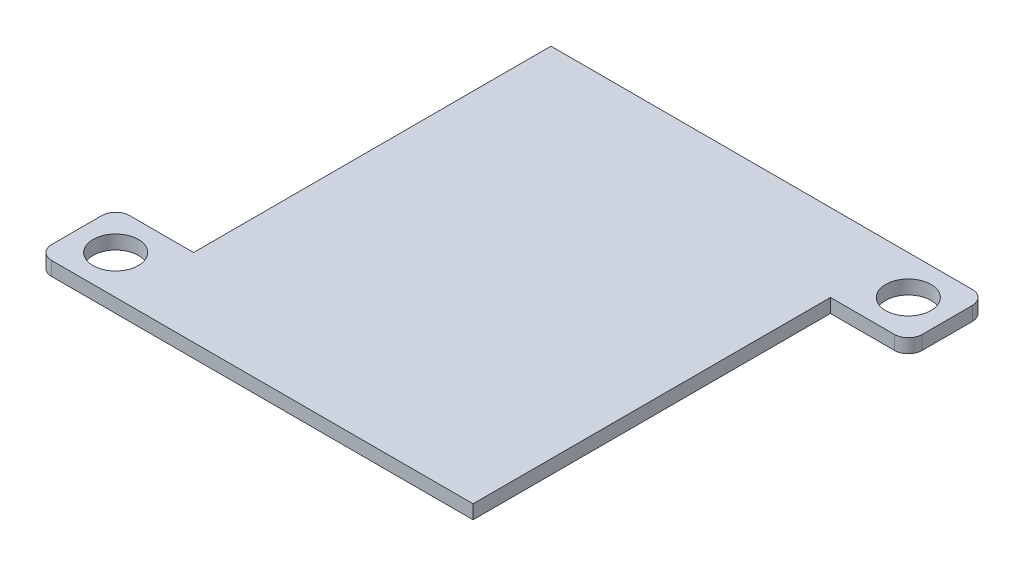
ISO-10303-21;
HEADER;
FILE_DESCRIPTION(('STEP AP214'),'2;1');
FILE_NAME('part.step','',(''),(''),'','','');
FILE_SCHEMA(('AUTOMOTIVE_DESIGN { 1 0 10303 214 1 1 1 1 }'));
ENDSEC;
DATA;
#1=APPLICATION_CONTEXT('core data for automotive mechanical design processes');
#2=APPLICATION_PROTOCOL_DEFINITION('international standard','automotive_design',2000,#1);
#3=PRODUCT_CONTEXT('',#1,'mechanical');
#4=PRODUCT('Part','Part','',(#3));
#5=PRODUCT_RELATED_PRODUCT_CATEGORY('part','',(#4));
#6=PRODUCT_DEFINITION_FORMATION('','',#4);
#7=PRODUCT_DEFINITION_CONTEXT('part definition',#1,'design');
#8=PRODUCT_DEFINITION('design','',#6,#7);
#9=PRODUCT_DEFINITION_SHAPE('','',#8);
#10=(LENGTH_UNIT() NAMED_UNIT(*) SI_UNIT(.MILLI.,.METRE.));
#11=(NAMED_UNIT(*) PLANE_ANGLE_UNIT() SI_UNIT($,.RADIAN.));
#12=(NAMED_UNIT(*) SI_UNIT($,.STERADIAN.) SOLID_ANGLE_UNIT());
#13=UNCERTAINTY_MEASURE_WITH_UNIT(LENGTH_MEASURE(1.E-05),#10,'distance_accuracy_value','');
#14=(GEOMETRIC_REPRESENTATION_CONTEXT(3) GLOBAL_UNCERTAINTY_ASSIGNED_CONTEXT((#13)) GLOBAL_UNIT_ASSIGNED_CONTEXT((#10,
#11,#12)) REPRESENTATION_CONTEXT('',''));
#15=CARTESIAN_POINT('',(0.,0.,0.));
#16=DIRECTION('',(0.,0.,1.));
#17=DIRECTION('',(1.,0.,0.));
#18=AXIS2_PLACEMENT_3D('',#15,#16,#17);
#19=CARTESIAN_POINT('',(0.,1.,0.));
#20=DIRECTION('',(0.,1.,0.));
#21=DIRECTION('',(0.,0.,1.));
#22=AXIS2_PLACEMENT_3D('',#19,#20,#21);
#23=PLANE('',#22);
#24=CARTESIAN_POINT('',(15.7634815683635,1.,-12.7117909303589));
#25=DIRECTION('',(0.,1.,0.));
#26=DIRECTION('',(0.,0.,1.));
#27=AXIS2_PLACEMENT_3D('',#24,#25,#26);
#28=CIRCLE('',#27,1.63);
#29=CARTESIAN_POINT('',(15.7634815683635,1.,-11.0817909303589));
#30=VERTEX_POINT('',#29);
#31=EDGE_CURVE('E224',#30,#30,#28,.T.);
#32=ORIENTED_EDGE('',*,*,#31,.F.);
#33=EDGE_LOOP('',(#32));
#34=FACE_BOUND('',#33,.T.);
#35=DIRECTION('',(-1.,0.,0.));
#36=VECTOR('',#35,1.);
#37=CARTESIAN_POINT('',(-12.7365184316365,1.,10.1882090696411));
#38=LINE('',#37,#36);
#39=CARTESIAN_POINT('',(-12.7365184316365,1.,10.1882090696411));
#40=VERTEX_POINT('',#39);
#41=CARTESIAN_POINT('',(-17.3365184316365,1.,10.1882090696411));
#42=VERTEX_POINT('',#41);
#43=EDGE_CURVE('E121',#40,#42,#38,.T.);
#44=ORIENTED_EDGE('',*,*,#43,.T.);
#45=CARTESIAN_POINT('',(-17.3365184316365,1.,11.1882090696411));
#46=DIRECTION('',(0.,1.,0.));
#47=DIRECTION('',(0.,0.,1.));
#48=AXIS2_PLACEMENT_3D('',#45,#46,#47);
#49=CIRCLE('',#48,1.);
#50=CARTESIAN_POINT('',(-18.3365184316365,1.,11.1882090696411));
#51=VERTEX_POINT('',#50);
#52=EDGE_CURVE('E171',#42,#51,#49,.T.);
#53=ORIENTED_EDGE('',*,*,#52,.T.);
#54=DIRECTION('',(0.,0.,1.));
#55=VECTOR('',#54,1.);
#56=CARTESIAN_POINT('',(-18.3365184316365,1.,15.7882090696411));
#57=LINE('',#56,#55);
#58=CARTESIAN_POINT('',(-18.3365184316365,1.,14.7882090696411));
#59=VERTEX_POINT('',#58);
#60=EDGE_CURVE('E131',#51,#59,#57,.T.);
#61=ORIENTED_EDGE('',*,*,#60,.T.);
#62=CARTESIAN_POINT('',(-17.3365184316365,1.,14.7882090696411));
#63=DIRECTION('',(0.,1.,0.));
#64=DIRECTION('',(0.,0.,1.));
#65=AXIS2_PLACEMENT_3D('',#62,#63,#64);
#66=CIRCLE('',#65,1.);
#67=CARTESIAN_POINT('',(-17.3365184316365,1.,15.7882090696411));
#68=VERTEX_POINT('',#67);
#69=EDGE_CURVE('E169',#59,#68,#66,.T.);
#70=ORIENTED_EDGE('',*,*,#69,.T.);
#71=DIRECTION('',(1.,0.,0.));
#72=VECTOR('',#71,1.);
#73=CARTESIAN_POINT('',(-13.2965184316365,1.,15.7882090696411));
#74=LINE('',#73,#72);
#75=CARTESIAN_POINT('',(12.9634815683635,1.,15.7882090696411));
#76=VERTEX_POINT('',#75);
#77=EDGE_CURVE('E230',#68,#76,#74,.T.);
#78=ORIENTED_EDGE('',*,*,#77,.T.);
#79=DIRECTION('',(0.,0.,-1.));
#80=VECTOR('',#79,1.);
#81=CARTESIAN_POINT('',(12.9634815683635,1.,15.7882090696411));
#82=LINE('',#81,#80);
#83=CARTESIAN_POINT('',(12.9634815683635,1.,-9.91179093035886));
#84=VERTEX_POINT('',#83);
#85=EDGE_CURVE('E228',#76,#84,#82,.T.);
#86=ORIENTED_EDGE('',*,*,#85,.T.);
#87=DIRECTION('',(1.,0.,0.));
#88=VECTOR('',#87,1.);
#89=CARTESIAN_POINT('',(12.9634815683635,1.,-9.91179093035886));
#90=LINE('',#89,#88);
#91=CARTESIAN_POINT('',(17.5634815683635,1.,-9.91179093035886));
#92=VERTEX_POINT('',#91);
#93=EDGE_CURVE('E210',#84,#92,#90,.T.);
#94=ORIENTED_EDGE('',*,*,#93,.T.);
#95=CARTESIAN_POINT('',(17.5634815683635,1.,-10.9117909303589));
#96=DIRECTION('',(0.,1.,0.));
#97=DIRECTION('',(0.,0.,1.));
#98=AXIS2_PLACEMENT_3D('',#95,#96,#97);
#99=CIRCLE('',#98,1.);
#100=CARTESIAN_POINT('',(18.5634815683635,1.,-10.9117909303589));
#101=VERTEX_POINT('',#100);
#102=EDGE_CURVE('E166',#92,#101,#99,.T.);
#103=ORIENTED_EDGE('',*,*,#102,.T.);
#104=DIRECTION('',(0.,0.,-1.));
#105=VECTOR('',#104,1.);
#106=CARTESIAN_POINT('',(18.5634815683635,1.,-15.5117909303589));
#107=LINE('',#106,#105);
#108=CARTESIAN_POINT('',(18.5634815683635,1.,-14.5117909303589));
#109=VERTEX_POINT('',#108);
#110=EDGE_CURVE('E185',#101,#109,#107,.T.);
#111=ORIENTED_EDGE('',*,*,#110,.T.);
#112=CARTESIAN_POINT('',(17.5634815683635,1.,-14.5117909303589));
#113=DIRECTION('',(0.,1.,0.));
#114=DIRECTION('',(0.,0.,1.));
#115=AXIS2_PLACEMENT_3D('',#112,#113,#114);
#116=CIRCLE('',#115,1.);
#117=CARTESIAN_POINT('',(17.5634815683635,1.,-15.5117909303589));
#118=VERTEX_POINT('',#117);
#119=EDGE_CURVE('E47',#109,#118,#116,.T.);
#120=ORIENTED_EDGE('',*,*,#119,.T.);
#121=DIRECTION('',(-1.,0.,0.));
#122=VECTOR('',#121,1.);
#123=CARTESIAN_POINT('',(12.9634815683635,1.,-15.5117909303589));
#124=LINE('',#123,#122);
#125=CARTESIAN_POINT('',(-12.7365184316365,1.,-15.5117909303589));
#126=VERTEX_POINT('',#125);
#127=EDGE_CURVE('E136',#118,#126,#124,.T.);
#128=ORIENTED_EDGE('',*,*,#127,.T.);
#129=DIRECTION('',(0.,0.,1.));
#130=VECTOR('',#129,1.);
#131=CARTESIAN_POINT('',(-12.7365184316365,1.,10.1882090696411));
#132=LINE('',#131,#130);
#133=EDGE_CURVE('E132',#126,#40,#132,.T.);
#134=ORIENTED_EDGE('',*,*,#133,.T.);
#135=EDGE_LOOP('',(#44,#53,#61,#70,#78,#86,#94,#103,#111,#120,#128,#134));
#136=FACE_BOUND('',#135,.T.);
#137=CARTESIAN_POINT('',(-15.5365184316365,1.,12.9882090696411));
#138=DIRECTION('',(0.,1.,0.));
#139=DIRECTION('',(0.,0.,1.));
#140=AXIS2_PLACEMENT_3D('',#137,#138,#139);
#141=CIRCLE('',#140,1.63);
#142=CARTESIAN_POINT('',(-15.5365184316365,1.,14.6182090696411));
#143=VERTEX_POINT('',#142);
#144=EDGE_CURVE('E237',#143,#143,#141,.T.);
#145=ORIENTED_EDGE('',*,*,#144,.F.);
#146=EDGE_LOOP('',(#145));
#147=FACE_BOUND('',#146,.T.);
#148=ADVANCED_FACE('F32',(#34,#136,#147),#23,.T.);
#149=CARTESIAN_POINT('',(0.,0.,0.));
#150=DIRECTION('',(0.,1.,0.));
#151=DIRECTION('',(0.,0.,1.));
#152=AXIS2_PLACEMENT_3D('',#149,#150,#151);
#153=PLANE('',#152);
#154=DIRECTION('',(0.,0.,1.));
#155=VECTOR('',#154,1.);
#156=CARTESIAN_POINT('',(-18.3365184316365,0.,15.7882090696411));
#157=LINE('',#156,#155);
#158=CARTESIAN_POINT('',(-18.3365184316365,0.,11.1882090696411));
#159=VERTEX_POINT('',#158);
#160=CARTESIAN_POINT('',(-18.3365184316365,0.,14.7882090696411));
#161=VERTEX_POINT('',#160);
#162=EDGE_CURVE('E216',#159,#161,#157,.T.);
#163=ORIENTED_EDGE('',*,*,#162,.F.);
#164=CARTESIAN_POINT('',(-17.3365184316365,0.,11.1882090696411));
#165=DIRECTION('',(0.,1.,0.));
#166=DIRECTION('',(0.,0.,1.));
#167=AXIS2_PLACEMENT_3D('',#164,#165,#166);
#168=CIRCLE('',#167,1.);
#169=CARTESIAN_POINT('',(-17.3365184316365,0.,10.1882090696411));
#170=VERTEX_POINT('',#169);
#171=EDGE_CURVE('E163',#159,#170,#168,.F.);
#172=ORIENTED_EDGE('',*,*,#171,.T.);
#173=DIRECTION('',(-1.,0.,0.));
#174=VECTOR('',#173,1.);
#175=CARTESIAN_POINT('',(-12.7365184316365,0.,10.1882090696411));
#176=LINE('',#175,#174);
#177=CARTESIAN_POINT('',(-12.7365184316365,0.,10.1882090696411));
#178=VERTEX_POINT('',#177);
#179=EDGE_CURVE('E221',#178,#170,#176,.T.);
#180=ORIENTED_EDGE('',*,*,#179,.F.);
#181=DIRECTION('',(0.,0.,1.));
#182=VECTOR('',#181,1.);
#183=CARTESIAN_POINT('',(-12.7365184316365,0.,10.1882090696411));
#184=LINE('',#183,#182);
#185=CARTESIAN_POINT('',(-12.7365184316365,0.,-15.5117909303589));
#186=VERTEX_POINT('',#185);
#187=EDGE_CURVE('E144',#186,#178,#184,.T.);
#188=ORIENTED_EDGE('',*,*,#187,.F.);
#189=DIRECTION('',(-1.,0.,0.));
#190=VECTOR('',#189,1.);
#191=CARTESIAN_POINT('',(12.9634815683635,0.,-15.5117909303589));
#192=LINE('',#191,#190);
#193=CARTESIAN_POINT('',(17.5634815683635,0.,-15.5117909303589));
#194=VERTEX_POINT('',#193);
#195=EDGE_CURVE('E140',#194,#186,#192,.T.);
#196=ORIENTED_EDGE('',*,*,#195,.F.);
#197=CARTESIAN_POINT('',(17.5634815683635,0.,-14.5117909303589));
#198=DIRECTION('',(0.,1.,0.));
#199=DIRECTION('',(0.,0.,1.));
#200=AXIS2_PLACEMENT_3D('',#197,#198,#199);
#201=CIRCLE('',#200,1.);
#202=CARTESIAN_POINT('',(18.5634815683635,0.,-14.5117909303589));
#203=VERTEX_POINT('',#202);
#204=EDGE_CURVE('E159',#194,#203,#201,.F.);
#205=ORIENTED_EDGE('',*,*,#204,.T.);
#206=DIRECTION('',(0.,0.,-1.));
#207=VECTOR('',#206,1.);
#208=CARTESIAN_POINT('',(18.5634815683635,0.,-15.5117909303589));
#209=LINE('',#208,#207);
#210=CARTESIAN_POINT('',(18.5634815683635,0.,-10.9117909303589));
#211=VERTEX_POINT('',#210);
#212=EDGE_CURVE('E184',#211,#203,#209,.T.);
#213=ORIENTED_EDGE('',*,*,#212,.F.);
#214=CARTESIAN_POINT('',(17.5634815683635,0.,-10.9117909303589));
#215=DIRECTION('',(0.,1.,0.));
#216=DIRECTION('',(0.,0.,1.));
#217=AXIS2_PLACEMENT_3D('',#214,#215,#216);
#218=CIRCLE('',#217,1.);
#219=CARTESIAN_POINT('',(17.5634815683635,0.,-9.91179093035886));
#220=VERTEX_POINT('',#219);
#221=EDGE_CURVE('E157',#211,#220,#218,.F.);
#222=ORIENTED_EDGE('',*,*,#221,.T.);
#223=DIRECTION('',(1.,0.,0.));
#224=VECTOR('',#223,1.);
#225=CARTESIAN_POINT('',(12.9634815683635,0.,-9.91179093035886));
#226=LINE('',#225,#224);
#227=CARTESIAN_POINT('',(12.9634815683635,0.,-9.91179093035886));
#228=VERTEX_POINT('',#227);
#229=EDGE_CURVE('E195',#228,#220,#226,.T.);
#230=ORIENTED_EDGE('',*,*,#229,.F.);
#231=DIRECTION('',(0.,0.,-1.));
#232=VECTOR('',#231,1.);
#233=CARTESIAN_POINT('',(12.9634815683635,0.,15.7882090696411));
#234=LINE('',#233,#232);
#235=CARTESIAN_POINT('',(12.9634815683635,0.,15.7882090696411));
#236=VERTEX_POINT('',#235);
#237=EDGE_CURVE('E198',#236,#228,#234,.T.);
#238=ORIENTED_EDGE('',*,*,#237,.F.);
#239=DIRECTION('',(1.,0.,0.));
#240=VECTOR('',#239,1.);
#241=CARTESIAN_POINT('',(12.9634815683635,0.,15.7882090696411));
#242=LINE('',#241,#240);
#243=CARTESIAN_POINT('',(-17.3365184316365,0.,15.7882090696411));
#244=VERTEX_POINT('',#243);
#245=EDGE_CURVE('E215',#244,#236,#242,.T.);
#246=ORIENTED_EDGE('',*,*,#245,.F.);
#247=CARTESIAN_POINT('',(-17.3365184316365,0.,14.7882090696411));
#248=DIRECTION('',(0.,1.,0.));
#249=DIRECTION('',(0.,0.,1.));
#250=AXIS2_PLACEMENT_3D('',#247,#248,#249);
#251=CIRCLE('',#250,1.);
#252=EDGE_CURVE('E161',#244,#161,#251,.F.);
#253=ORIENTED_EDGE('',*,*,#252,.T.);
#254=EDGE_LOOP('',(#163,#172,#180,#188,#196,#205,#213,#222,#230,#238,#246,#253));
#255=FACE_BOUND('',#254,.T.);
#256=CARTESIAN_POINT('',(15.7634815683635,0.,-12.7117909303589));
#257=DIRECTION('',(0.,1.,0.));
#258=DIRECTION('',(0.,0.,1.));
#259=AXIS2_PLACEMENT_3D('',#256,#257,#258);
#260=CIRCLE('',#259,1.63);
#261=CARTESIAN_POINT('',(15.7634815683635,0.,-11.0817909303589));
#262=VERTEX_POINT('',#261);
#263=EDGE_CURVE('E234',#262,#262,#260,.T.);
#264=ORIENTED_EDGE('',*,*,#263,.T.);
#265=EDGE_LOOP('',(#264));
#266=FACE_BOUND('',#265,.T.);
#267=CARTESIAN_POINT('',(-15.5365184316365,0.,12.9882090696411));
#268=DIRECTION('',(0.,1.,0.));
#269=DIRECTION('',(0.,0.,1.));
#270=AXIS2_PLACEMENT_3D('',#267,#268,#269);
#271=CIRCLE('',#270,1.63);
#272=CARTESIAN_POINT('',(-15.5365184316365,0.,14.6182090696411));
#273=VERTEX_POINT('',#272);
#274=EDGE_CURVE('E240',#273,#273,#271,.T.);
#275=ORIENTED_EDGE('',*,*,#274,.T.);
#276=EDGE_LOOP('',(#275));
#277=FACE_BOUND('',#276,.T.);
#278=ADVANCED_FACE('F190',(#255,#266,#277),#153,.F.);
#279=CARTESIAN_POINT('',(-12.7365184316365,1.,10.1882090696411));
#280=DIRECTION('',(1.,0.,0.));
#281=DIRECTION('',(0.,0.,-1.));
#282=AXIS2_PLACEMENT_3D('',#279,#280,#281);
#283=PLANE('',#282);
#284=ORIENTED_EDGE('',*,*,#187,.T.);
#285=DIRECTION('',(0.,-1.,0.));
#286=VECTOR('',#285,1.);
#287=CARTESIAN_POINT('',(-12.7365184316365,1.,10.1882090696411));
#288=LINE('',#287,#286);
#289=EDGE_CURVE('E126',#40,#178,#288,.T.);
#290=ORIENTED_EDGE('',*,*,#289,.F.);
#291=ORIENTED_EDGE('',*,*,#133,.F.);
#292=DIRECTION('',(0.,-1.,0.));
#293=VECTOR('',#292,1.);
#294=CARTESIAN_POINT('',(-12.7365184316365,1.,-15.5117909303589));
#295=LINE('',#294,#293);
#296=EDGE_CURVE('E202',#126,#186,#295,.T.);
#297=ORIENTED_EDGE('',*,*,#296,.T.);
#298=EDGE_LOOP('',(#284,#290,#291,#297));
#299=FACE_BOUND('',#298,.T.);
#300=ADVANCED_FACE('F142',(#299),#283,.F.);
#301=CARTESIAN_POINT('',(-12.7365184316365,1.,10.1882090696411));
#302=DIRECTION('',(0.,0.,1.));
#303=DIRECTION('',(1.,0.,0.));
#304=AXIS2_PLACEMENT_3D('',#301,#302,#303);
#305=PLANE('',#304);
#306=ORIENTED_EDGE('',*,*,#179,.T.);
#307=DIRECTION('',(0.,-1.,0.));
#308=VECTOR('',#307,1.);
#309=CARTESIAN_POINT('',(-17.3365184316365,1.,10.1882090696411));
#310=LINE('',#309,#308);
#311=EDGE_CURVE('E129',#170,#42,#310,.F.);
#312=ORIENTED_EDGE('',*,*,#311,.T.);
#313=ORIENTED_EDGE('',*,*,#43,.F.);
#314=ORIENTED_EDGE('',*,*,#289,.T.);
#315=EDGE_LOOP('',(#306,#312,#313,#314));
#316=FACE_BOUND('',#315,.T.);
#317=ADVANCED_FACE('F124',(#316),#305,.F.);
#318=CARTESIAN_POINT('',(-18.3365184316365,1.,15.7882090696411));
#319=DIRECTION('',(1.,0.,0.));
#320=DIRECTION('',(0.,0.,-1.));
#321=AXIS2_PLACEMENT_3D('',#318,#319,#320);
#322=PLANE('',#321);
#323=ORIENTED_EDGE('',*,*,#60,.F.);
#324=DIRECTION('',(0.,-1.,0.));
#325=VECTOR('',#324,1.);
#326=CARTESIAN_POINT('',(-18.3365184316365,1.,11.1882090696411));
#327=LINE('',#326,#325);
#328=EDGE_CURVE('E148',#51,#159,#327,.T.);
#329=ORIENTED_EDGE('',*,*,#328,.T.);
#330=ORIENTED_EDGE('',*,*,#162,.T.);
#331=DIRECTION('',(0.,-1.,0.));
#332=VECTOR('',#331,1.);
#333=CARTESIAN_POINT('',(-18.3365184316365,1.,14.7882090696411));
#334=LINE('',#333,#332);
#335=EDGE_CURVE('E145',#161,#59,#334,.F.);
#336=ORIENTED_EDGE('',*,*,#335,.T.);
#337=EDGE_LOOP('',(#323,#329,#330,#336));
#338=FACE_BOUND('',#337,.T.);
#339=ADVANCED_FACE('F274',(#338),#322,.F.);
#340=CARTESIAN_POINT('',(12.9634815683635,1.,15.7882090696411));
#341=DIRECTION('',(0.,0.,-1.));
#342=DIRECTION('',(-1.,0.,0.));
#343=AXIS2_PLACEMENT_3D('',#340,#341,#342);
#344=PLANE('',#343);
#345=ORIENTED_EDGE('',*,*,#77,.F.);
#346=DIRECTION('',(0.,-1.,0.));
#347=VECTOR('',#346,1.);
#348=CARTESIAN_POINT('',(-17.3365184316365,1.,15.7882090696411));
#349=LINE('',#348,#347);
#350=EDGE_CURVE('E173',#68,#244,#349,.T.);
#351=ORIENTED_EDGE('',*,*,#350,.T.);
#352=ORIENTED_EDGE('',*,*,#245,.T.);
#353=DIRECTION('',(0.,-1.,0.));
#354=VECTOR('',#353,1.);
#355=CARTESIAN_POINT('',(12.9634815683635,1.,15.7882090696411));
#356=LINE('',#355,#354);
#357=EDGE_CURVE('E146',#76,#236,#356,.T.);
#358=ORIENTED_EDGE('',*,*,#357,.F.);
#359=EDGE_LOOP('',(#345,#351,#352,#358));
#360=FACE_BOUND('',#359,.T.);
#361=ADVANCED_FACE('F271',(#360),#344,.F.);
#362=CARTESIAN_POINT('',(12.9634815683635,1.,15.7882090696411));
#363=DIRECTION('',(-1.,0.,0.));
#364=DIRECTION('',(0.,0.,1.));
#365=AXIS2_PLACEMENT_3D('',#362,#363,#364);
#366=PLANE('',#365);
#367=ORIENTED_EDGE('',*,*,#237,.T.);
#368=DIRECTION('',(0.,-1.,0.));
#369=VECTOR('',#368,1.);
#370=CARTESIAN_POINT('',(12.9634815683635,1.,-9.91179093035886));
#371=LINE('',#370,#369);
#372=EDGE_CURVE('E151',#84,#228,#371,.T.);
#373=ORIENTED_EDGE('',*,*,#372,.F.);
#374=ORIENTED_EDGE('',*,*,#85,.F.);
#375=ORIENTED_EDGE('',*,*,#357,.T.);
#376=EDGE_LOOP('',(#367,#373,#374,#375));
#377=FACE_BOUND('',#376,.T.);
#378=ADVANCED_FACE('F268',(#377),#366,.F.);
#379=CARTESIAN_POINT('',(12.9634815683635,1.,-9.91179093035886));
#380=DIRECTION('',(0.,0.,-1.));
#381=DIRECTION('',(-1.,0.,0.));
#382=AXIS2_PLACEMENT_3D('',#379,#380,#381);
#383=PLANE('',#382);
#384=ORIENTED_EDGE('',*,*,#229,.T.);
#385=DIRECTION('',(0.,-1.,0.));
#386=VECTOR('',#385,1.);
#387=CARTESIAN_POINT('',(17.5634815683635,1.,-9.91179093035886));
#388=LINE('',#387,#386);
#389=EDGE_CURVE('E11',#220,#92,#388,.F.);
#390=ORIENTED_EDGE('',*,*,#389,.T.);
#391=ORIENTED_EDGE('',*,*,#93,.F.);
#392=ORIENTED_EDGE('',*,*,#372,.T.);
#393=EDGE_LOOP('',(#384,#390,#391,#392));
#394=FACE_BOUND('',#393,.T.);
#395=ADVANCED_FACE('F207',(#394),#383,.F.);
#396=CARTESIAN_POINT('',(18.5634815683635,1.,-15.5117909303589));
#397=DIRECTION('',(-1.,0.,0.));
#398=DIRECTION('',(0.,0.,1.));
#399=AXIS2_PLACEMENT_3D('',#396,#397,#398);
#400=PLANE('',#399);
#401=ORIENTED_EDGE('',*,*,#212,.T.);
#402=DIRECTION('',(0.,-1.,0.));
#403=VECTOR('',#402,1.);
#404=CARTESIAN_POINT('',(18.5634815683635,1.,-14.5117909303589));
#405=LINE('',#404,#403);
#406=EDGE_CURVE('E40',#203,#109,#405,.F.);
#407=ORIENTED_EDGE('',*,*,#406,.T.);
#408=ORIENTED_EDGE('',*,*,#110,.F.);
#409=DIRECTION('',(0.,-1.,0.));
#410=VECTOR('',#409,1.);
#411=CARTESIAN_POINT('',(18.5634815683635,1.,-10.9117909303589));
#412=LINE('',#411,#410);
#413=EDGE_CURVE('E179',#101,#211,#412,.T.);
#414=ORIENTED_EDGE('',*,*,#413,.T.);
#415=EDGE_LOOP('',(#401,#407,#408,#414));
#416=FACE_BOUND('',#415,.T.);
#417=ADVANCED_FACE('F183',(#416),#400,.F.);
#418=CARTESIAN_POINT('',(12.9634815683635,1.,-15.5117909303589));
#419=DIRECTION('',(0.,0.,1.));
#420=DIRECTION('',(1.,0.,0.));
#421=AXIS2_PLACEMENT_3D('',#418,#419,#420);
#422=PLANE('',#421);
#423=ORIENTED_EDGE('',*,*,#127,.F.);
#424=DIRECTION('',(0.,-1.,0.));
#425=VECTOR('',#424,1.);
#426=CARTESIAN_POINT('',(17.5634815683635,1.,-15.5117909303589));
#427=LINE('',#426,#425);
#428=EDGE_CURVE('E176',#118,#194,#427,.T.);
#429=ORIENTED_EDGE('',*,*,#428,.T.);
#430=ORIENTED_EDGE('',*,*,#195,.T.);
#431=ORIENTED_EDGE('',*,*,#296,.F.);
#432=EDGE_LOOP('',(#423,#429,#430,#431));
#433=FACE_BOUND('',#432,.T.);
#434=ADVANCED_FACE('F260',(#433),#422,.F.);
#435=CARTESIAN_POINT('',(15.7634815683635,1.,-12.7117909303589));
#436=DIRECTION('',(0.,-1.,0.));
#437=DIRECTION('',(0.,0.,-1.));
#438=AXIS2_PLACEMENT_3D('',#435,#436,#437);
#439=CYLINDRICAL_SURFACE('',#438,1.63);
#440=ORIENTED_EDGE('',*,*,#31,.T.);
#441=EDGE_LOOP('',(#440));
#442=FACE_BOUND('',#441,.T.);
#443=ORIENTED_EDGE('',*,*,#263,.F.);
#444=EDGE_LOOP('',(#443));
#445=FACE_BOUND('',#444,.T.);
#446=ADVANCED_FACE('F257',(#442,#445),#439,.F.);
#447=CARTESIAN_POINT('',(-15.5365184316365,1.,12.9882090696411));
#448=DIRECTION('',(0.,-1.,0.));
#449=DIRECTION('',(0.,0.,-1.));
#450=AXIS2_PLACEMENT_3D('',#447,#448,#449);
#451=CYLINDRICAL_SURFACE('',#450,1.63);
#452=ORIENTED_EDGE('',*,*,#144,.T.);
#453=EDGE_LOOP('',(#452));
#454=FACE_BOUND('',#453,.T.);
#455=ORIENTED_EDGE('',*,*,#274,.F.);
#456=EDGE_LOOP('',(#455));
#457=FACE_BOUND('',#456,.T.);
#458=ADVANCED_FACE('F246',(#454,#457),#451,.F.);
#459=CARTESIAN_POINT('',(-17.3365184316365,1.,11.1882090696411));
#460=DIRECTION('',(0.,-1.,0.));
#461=DIRECTION('',(0.,0.,-1.));
#462=AXIS2_PLACEMENT_3D('',#459,#460,#461);
#463=CYLINDRICAL_SURFACE('',#462,1.);
#464=ORIENTED_EDGE('',*,*,#52,.F.);
#465=ORIENTED_EDGE('',*,*,#311,.F.);
#466=ORIENTED_EDGE('',*,*,#171,.F.);
#467=ORIENTED_EDGE('',*,*,#328,.F.);
#468=EDGE_LOOP('',(#464,#465,#466,#467));
#469=FACE_BOUND('',#468,.T.);
#470=ADVANCED_FACE('F283',(#469),#463,.T.);
#471=CARTESIAN_POINT('',(-17.3365184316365,1.,14.7882090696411));
#472=DIRECTION('',(0.,-1.,0.));
#473=DIRECTION('',(0.,0.,-1.));
#474=AXIS2_PLACEMENT_3D('',#471,#472,#473);
#475=CYLINDRICAL_SURFACE('',#474,1.);
#476=ORIENTED_EDGE('',*,*,#69,.F.);
#477=ORIENTED_EDGE('',*,*,#335,.F.);
#478=ORIENTED_EDGE('',*,*,#252,.F.);
#479=ORIENTED_EDGE('',*,*,#350,.F.);
#480=EDGE_LOOP('',(#476,#477,#478,#479));
#481=FACE_BOUND('',#480,.T.);
#482=ADVANCED_FACE('F286',(#481),#475,.T.);
#483=CARTESIAN_POINT('',(17.5634815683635,1.,-14.5117909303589));
#484=DIRECTION('',(0.,-1.,0.));
#485=DIRECTION('',(0.,0.,-1.));
#486=AXIS2_PLACEMENT_3D('',#483,#484,#485);
#487=CYLINDRICAL_SURFACE('',#486,1.);
#488=ORIENTED_EDGE('',*,*,#119,.F.);
#489=ORIENTED_EDGE('',*,*,#406,.F.);
#490=ORIENTED_EDGE('',*,*,#204,.F.);
#491=ORIENTED_EDGE('',*,*,#428,.F.);
#492=EDGE_LOOP('',(#488,#489,#490,#491));
#493=FACE_BOUND('',#492,.T.);
#494=ADVANCED_FACE('F289',(#493),#487,.T.);
#495=CARTESIAN_POINT('',(17.5634815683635,1.,-10.9117909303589));
#496=DIRECTION('',(0.,-1.,0.));
#497=DIRECTION('',(0.,0.,-1.));
#498=AXIS2_PLACEMENT_3D('',#495,#496,#497);
#499=CYLINDRICAL_SURFACE('',#498,1.);
#500=ORIENTED_EDGE('',*,*,#102,.F.);
#501=ORIENTED_EDGE('',*,*,#389,.F.);
#502=ORIENTED_EDGE('',*,*,#221,.F.);
#503=ORIENTED_EDGE('',*,*,#413,.F.);
#504=EDGE_LOOP('',(#500,#501,#502,#503));
#505=FACE_BOUND('',#504,.T.);
#506=ADVANCED_FACE('F34',(#505),#499,.T.);
#507=CLOSED_SHELL('',(#148,#278,#300,#317,#339,#361,#378,#395,#417,#434,#446,#458,#470,#482,
#494,#506));
#508=MANIFOLD_SOLID_BREP('B2',#507);
#509=ADVANCED_BREP_SHAPE_REPRESENTATION('',(#18,#508),#14);
#510=SHAPE_DEFINITION_REPRESENTATION(#9,#509);
ENDSEC;
END-ISO-10303-21;
